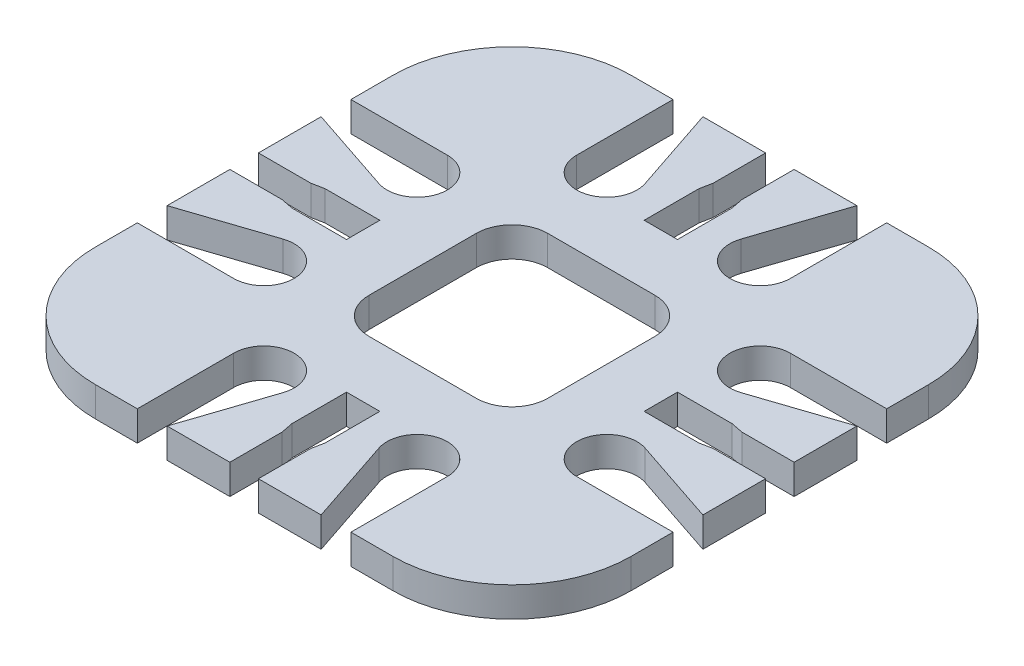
from build123d import *

# Parameters (mm, degrees)
BOSS_EXTRUDE1_DEPTH = 2.5


with BuildPart() as part:
    # Sketch1 → Boss-Extrude1 (new body)
    with BuildSketch(Plane(origin=(0, 0, 0), x_dir=(1, 0, 0), z_dir=(0, 1, 0))):
        with BuildLine():
            Line((1.2, -22.5), (1.2, -18.1))
            Line((1.2, -18.1), (1.4, -17.1))
            Line((1.4, -17.1), (1.4, -12.5))
            Line((1.4, -12.5), (-1.4, -12.5))
            Line((-1.4, -12.5), (-1.4, -17.1))
            Line((-1.4, -17.1), (-1.2, -18.1))
            Line((-1.2, -18.1), (-1.2, -22.5))
            Line((-1.2, -22.5), (-6.467967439, -22.5))
            Line((-6.467967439, -22.5), (-4.030816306, -15.208289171))
            ThreePointArc((-4.030816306, -15.208289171), (-6.029170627, -11.900657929), (-8.972974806, -14.404227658))
            Line((-8.972974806, -14.404227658), (-8.972974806, -22.5))
            Line((-8.972974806, -22.5), (-12.5, -22.5))
            ThreePointArc((-12.5, -22.5), (-19.571067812, -19.571067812), (-22.5, -12.5))
            Line((-22.5, -12.5), (-22.5, -8.972974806))
            Line((-22.5, -8.972974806), (-14.404227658, -8.972974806))
            ThreePointArc((-14.404227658, -8.972974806), (-11.900657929, -6.029170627), (-15.208289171, -4.030816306))
            Line((-15.208289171, -4.030816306), (-22.5, -6.467967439))
            Line((-22.5, -6.467967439), (-22.5, -1.2))
            Line((-22.5, -1.2), (-18.1, -1.2))
            Line((-18.1, -1.2), (-17.1, -1.4))
            Line((-17.1, -1.4), (-12.5, -1.4))
            Line((-12.5, -1.4), (-12.5, 1.4))
            Line((-12.5, 1.4), (-17.1, 1.4))
            Line((-17.1, 1.4), (-18.1, 1.2))
            Line((-18.1, 1.2), (-22.5, 1.2))
            Line((-22.5, 1.2), (-22.5, 6.467967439))
            Line((-22.5, 6.467967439), (-15.208289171, 4.030816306))
            ThreePointArc((-15.208289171, 4.030816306), (-11.900657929, 6.029170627), (-14.404227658, 8.972974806))
            Line((-14.404227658, 8.972974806), (-22.5, 8.972974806))
            Line((-22.5, 8.972974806), (-22.5, 12.5))
            ThreePointArc((-22.5, 12.5), (-19.571067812, 19.571067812), (-12.5, 22.5))
            Line((-12.5, 22.5), (-8.972974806, 22.5))
            Line((-8.972974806, 22.5), (-8.972974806, 14.404227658))
            ThreePointArc((-8.972974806, 14.404227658), (-6.029170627, 11.900657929), (-4.030816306, 15.208289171))
            Line((-4.030816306, 15.208289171), (-6.467967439, 22.5))
            Line((-6.467967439, 22.5), (-1.2, 22.5))
            Line((-1.2, 22.5), (-1.2, 18.1))
            Line((-1.2, 18.1), (-1.4, 17.1))
            Line((-1.4, 17.1), (-1.4, 12.5))
            Line((-1.4, 12.5), (1.4, 12.5))
            Line((1.4, 12.5), (1.4, 17.1))
            Line((1.4, 17.1), (1.2, 18.1))
            Line((1.2, 18.1), (1.2, 22.5))
            Line((1.2, 22.5), (6.467967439, 22.5))
            Line((6.467967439, 22.5), (4.030816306, 15.208289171))
            ThreePointArc((4.030816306, 15.208289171), (6.029170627, 11.900657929), (8.972974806, 14.404227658))
            Line((8.972974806, 14.404227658), (8.972974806, 22.5))
            Line((8.972974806, 22.5), (12.5, 22.5))
            ThreePointArc((12.5, 22.5), (19.571067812, 19.571067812), (22.5, 12.5))
            Line((22.5, 12.5), (22.5, 8.972974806))
            Line((22.5, 8.972974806), (14.404227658, 8.972974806))
            ThreePointArc((14.404227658, 8.972974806), (11.900657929, 6.029170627), (15.208289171, 4.030816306))
            Line((15.208289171, 4.030816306), (22.5, 6.467967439))
            Line((22.5, 6.467967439), (22.5, 1.2))
            Line((22.5, 1.2), (18.1, 1.2))
            Line((18.1, 1.2), (17.1, 1.4))
            Line((17.1, 1.4), (12.5, 1.4))
            Line((12.5, 1.4), (12.5, -1.4))
            Line((12.5, -1.4), (17.1, -1.4))
            Line((17.1, -1.4), (18.1, -1.2))
            Line((18.1, -1.2), (22.5, -1.2))
            Line((22.5, -1.2), (22.5, -6.467967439))
            Line((22.5, -6.467967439), (15.208289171, -4.030816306))
            ThreePointArc((15.208289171, -4.030816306), (11.900657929, -6.029170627), (14.404227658, -8.972974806))
            Line((14.404227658, -8.972974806), (22.5, -8.972974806))
            Line((22.5, -8.972974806), (22.5, -12.5))
            ThreePointArc((22.5, -12.5), (19.571067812, -19.571067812), (12.5, -22.5))
            Line((12.5, -22.5), (8.972974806, -22.5))
            Line((8.972974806, -22.5), (8.972974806, -14.404227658))
            ThreePointArc((8.972974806, -14.404227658), (6.029170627, -11.900657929), (4.030816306, -15.208289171))
            Line((4.030816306, -15.208289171), (6.467967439, -22.5))
            Line((6.467967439, -22.5), (1.2, -22.5))
        make_face()
        with BuildLine():
            Line((-4.5, 7.5), (4.5, 7.5))
            ThreePointArc((4.5, 7.5), (6.621320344, 6.621320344), (7.5, 4.5))
            Line((7.5, 4.5), (7.5, -4.5))
            ThreePointArc((7.5, -4.5), (6.621320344, -6.621320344), (4.5, -7.5))
            Line((4.5, -7.5), (-4.5, -7.5))
            ThreePointArc((-4.5, -7.5), (-6.621320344, -6.621320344), (-7.5, -4.5))
            Line((-7.5, -4.5), (-7.5, 4.5))
            ThreePointArc((-7.5, 4.5), (-6.621320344, 6.621320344), (-4.5, 7.5))
        make_face(mode=Mode.SUBTRACT)
    extrude(amount=BOSS_EXTRUDE1_DEPTH)


solid = part.part
